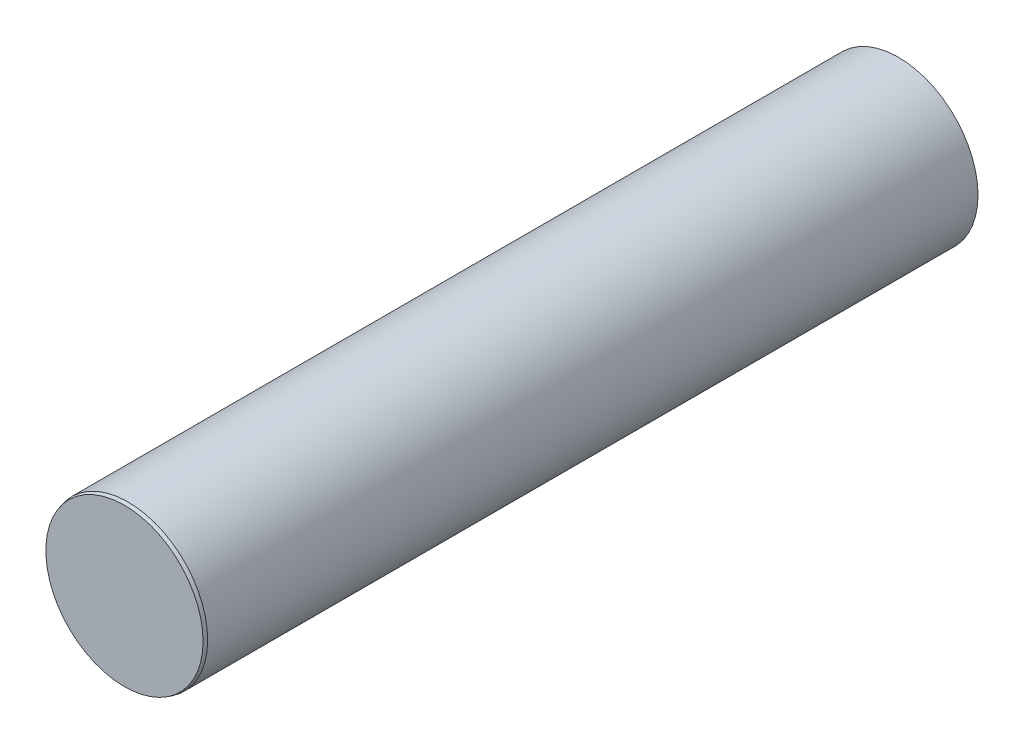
ISO-10303-21;
HEADER;
FILE_DESCRIPTION(('STEP AP214'),'2;1');
FILE_NAME('part.step','',(''),(''),'','','');
FILE_SCHEMA(('AUTOMOTIVE_DESIGN { 1 0 10303 214 1 1 1 1 }'));
ENDSEC;
DATA;
#1=APPLICATION_CONTEXT('core data for automotive mechanical design processes');
#2=APPLICATION_PROTOCOL_DEFINITION('international standard','automotive_design',2000,#1);
#3=PRODUCT_CONTEXT('',#1,'mechanical');
#4=PRODUCT('Part','Part','',(#3));
#5=PRODUCT_RELATED_PRODUCT_CATEGORY('part','',(#4));
#6=PRODUCT_DEFINITION_FORMATION('','',#4);
#7=PRODUCT_DEFINITION_CONTEXT('part definition',#1,'design');
#8=PRODUCT_DEFINITION('design','',#6,#7);
#9=PRODUCT_DEFINITION_SHAPE('','',#8);
#10=(LENGTH_UNIT() NAMED_UNIT(*) SI_UNIT(.MILLI.,.METRE.));
#11=(NAMED_UNIT(*) PLANE_ANGLE_UNIT() SI_UNIT($,.RADIAN.));
#12=(NAMED_UNIT(*) SI_UNIT($,.STERADIAN.) SOLID_ANGLE_UNIT());
#13=UNCERTAINTY_MEASURE_WITH_UNIT(LENGTH_MEASURE(1.E-05),#10,'distance_accuracy_value','');
#14=(GEOMETRIC_REPRESENTATION_CONTEXT(3) GLOBAL_UNCERTAINTY_ASSIGNED_CONTEXT((#13)) GLOBAL_UNIT_ASSIGNED_CONTEXT((#10,
#11,#12)) REPRESENTATION_CONTEXT('',''));
#15=CARTESIAN_POINT('',(0.,0.,0.));
#16=DIRECTION('',(0.,0.,1.));
#17=DIRECTION('',(1.,0.,0.));
#18=AXIS2_PLACEMENT_3D('',#15,#16,#17);
#19=CARTESIAN_POINT('',(0.,0.,107.));
#20=DIRECTION('',(0.,0.,-1.));
#21=DIRECTION('',(-1.,0.,0.));
#22=AXIS2_PLACEMENT_3D('',#19,#20,#21);
#23=CYLINDRICAL_SURFACE('',#22,11.);
#24=CARTESIAN_POINT('',(0.,0.,106.5));
#25=DIRECTION('',(0.,0.,1.));
#26=DIRECTION('',(1.,0.,0.));
#27=AXIS2_PLACEMENT_3D('',#24,#25,#26);
#28=CIRCLE('',#27,11.);
#29=CARTESIAN_POINT('',(11.,0.,106.5));
#30=VERTEX_POINT('',#29);
#31=EDGE_CURVE('E11',#30,#30,#28,.F.);
#32=ORIENTED_EDGE('',*,*,#31,.T.);
#33=EDGE_LOOP('',(#32));
#34=FACE_BOUND('',#33,.T.);
#35=CARTESIAN_POINT('',(0.,0.,0.));
#36=DIRECTION('',(0.,0.,1.));
#37=DIRECTION('',(1.,0.,0.));
#38=AXIS2_PLACEMENT_3D('',#35,#36,#37);
#39=CIRCLE('',#38,11.);
#40=CARTESIAN_POINT('',(11.,0.,0.));
#41=VERTEX_POINT('',#40);
#42=EDGE_CURVE('E35',#41,#41,#39,.T.);
#43=ORIENTED_EDGE('',*,*,#42,.T.);
#44=EDGE_LOOP('',(#43));
#45=FACE_BOUND('',#44,.T.);
#46=ADVANCED_FACE('F16',(#34,#45),#23,.T.);
#47=CARTESIAN_POINT('',(0.,0.,107.));
#48=DIRECTION('',(0.,0.,1.));
#49=DIRECTION('',(1.,0.,0.));
#50=AXIS2_PLACEMENT_3D('',#47,#48,#49);
#51=PLANE('',#50);
#52=CARTESIAN_POINT('',(0.,0.,107.));
#53=DIRECTION('',(0.,0.,1.));
#54=DIRECTION('',(1.,0.,0.));
#55=AXIS2_PLACEMENT_3D('',#52,#53,#54);
#56=CIRCLE('',#55,10.8660254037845);
#57=CARTESIAN_POINT('',(10.8660254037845,0.,107.));
#58=VERTEX_POINT('',#57);
#59=EDGE_CURVE('E23',#58,#58,#56,.T.);
#60=ORIENTED_EDGE('',*,*,#59,.T.);
#61=EDGE_LOOP('',(#60));
#62=FACE_BOUND('',#61,.T.);
#63=ADVANCED_FACE('F45',(#62),#51,.T.);
#64=CARTESIAN_POINT('',(0.,0.,0.));
#65=DIRECTION('',(0.,0.,1.));
#66=DIRECTION('',(1.,0.,0.));
#67=AXIS2_PLACEMENT_3D('',#64,#65,#66);
#68=PLANE('',#67);
#69=CARTESIAN_POINT('',(0.,0.,0.));
#70=DIRECTION('',(0.,0.,-1.));
#71=DIRECTION('',(-1.,0.,0.));
#72=AXIS2_PLACEMENT_3D('',#69,#70,#71);
#73=CIRCLE('',#72,2.5);
#74=CARTESIAN_POINT('',(-2.5,0.,0.));
#75=VERTEX_POINT('',#74);
#76=EDGE_CURVE('E36',#75,#75,#73,.T.);
#77=ORIENTED_EDGE('',*,*,#76,.F.);
#78=EDGE_LOOP('',(#77));
#79=FACE_BOUND('',#78,.T.);
#80=ORIENTED_EDGE('',*,*,#42,.F.);
#81=EDGE_LOOP('',(#80));
#82=FACE_BOUND('',#81,.T.);
#83=ADVANCED_FACE('F48',(#79,#82),#68,.F.);
#84=CARTESIAN_POINT('',(0.,0.,107.));
#85=DIRECTION('',(0.,0.,-1.));
#86=DIRECTION('',(-1.,0.,0.));
#87=AXIS2_PLACEMENT_3D('',#84,#85,#86);
#88=CONICAL_SURFACE('',#87,10.8660254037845,0.261799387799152);
#89=ORIENTED_EDGE('',*,*,#31,.F.);
#90=EDGE_LOOP('',(#89));
#91=FACE_BOUND('',#90,.T.);
#92=ORIENTED_EDGE('',*,*,#59,.F.);
#93=EDGE_LOOP('',(#92));
#94=FACE_BOUND('',#93,.T.);
#95=ADVANCED_FACE('F18',(#91,#94),#88,.T.);
#96=CARTESIAN_POINT('',(0.,0.,15.));
#97=DIRECTION('',(0.,0.,-1.));
#98=DIRECTION('',(-1.,0.,0.));
#99=AXIS2_PLACEMENT_3D('',#96,#97,#98);
#100=CONICAL_SURFACE('',#99,2.5,1.02974425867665);
#101=CARTESIAN_POINT('',(0.,0.,16.5021515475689));
#102=VERTEX_POINT('',#101);
#103=VERTEX_LOOP('',#102);
#104=FACE_BOUND('',#103,.T.);
#105=CARTESIAN_POINT('',(0.,0.,15.));
#106=DIRECTION('',(0.,0.,-1.));
#107=DIRECTION('',(-1.,0.,0.));
#108=AXIS2_PLACEMENT_3D('',#105,#106,#107);
#109=CIRCLE('',#108,2.5);
#110=CARTESIAN_POINT('',(-2.5,0.,15.));
#111=VERTEX_POINT('',#110);
#112=EDGE_CURVE('E33',#111,#111,#109,.T.);
#113=ORIENTED_EDGE('',*,*,#112,.T.);
#114=EDGE_LOOP('',(#113));
#115=FACE_BOUND('',#114,.T.);
#116=ADVANCED_FACE('F26',(#104,#115),#100,.F.);
#117=CARTESIAN_POINT('',(0.,0.,0.));
#118=DIRECTION('',(0.,0.,-1.));
#119=DIRECTION('',(-1.,0.,0.));
#120=AXIS2_PLACEMENT_3D('',#117,#118,#119);
#121=CYLINDRICAL_SURFACE('',#120,2.5);
#122=ORIENTED_EDGE('',*,*,#112,.F.);
#123=EDGE_LOOP('',(#122));
#124=FACE_BOUND('',#123,.T.);
#125=ORIENTED_EDGE('',*,*,#76,.T.);
#126=EDGE_LOOP('',(#125));
#127=FACE_BOUND('',#126,.T.);
#128=ADVANCED_FACE('F29',(#124,#127),#121,.F.);
#129=CLOSED_SHELL('',(#46,#63,#83,#95,#116,#128));
#130=MANIFOLD_SOLID_BREP('B1',#129);
#131=ADVANCED_BREP_SHAPE_REPRESENTATION('',(#18,#130),#14);
#132=SHAPE_DEFINITION_REPRESENTATION(#9,#131);
ENDSEC;
END-ISO-10303-21;
